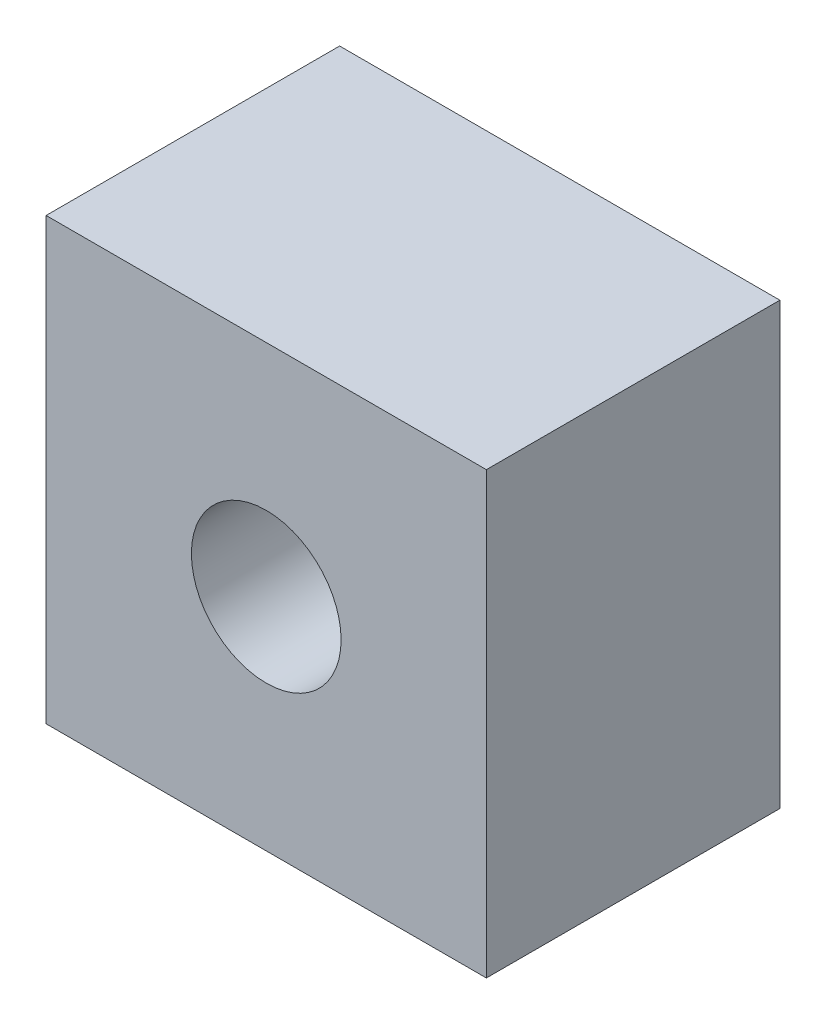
ISO-10303-21;
HEADER;
FILE_DESCRIPTION(('STEP AP214'),'2;1');
FILE_NAME('part.step','',(''),(''),'','','');
FILE_SCHEMA(('AUTOMOTIVE_DESIGN { 1 0 10303 214 1 1 1 1 }'));
ENDSEC;
DATA;
#1=APPLICATION_CONTEXT('core data for automotive mechanical design processes');
#2=APPLICATION_PROTOCOL_DEFINITION('international standard','automotive_design',2000,#1);
#3=PRODUCT_CONTEXT('',#1,'mechanical');
#4=PRODUCT('Part','Part','',(#3));
#5=PRODUCT_RELATED_PRODUCT_CATEGORY('part','',(#4));
#6=PRODUCT_DEFINITION_FORMATION('','',#4);
#7=PRODUCT_DEFINITION_CONTEXT('part definition',#1,'design');
#8=PRODUCT_DEFINITION('design','',#6,#7);
#9=PRODUCT_DEFINITION_SHAPE('','',#8);
#10=(LENGTH_UNIT() NAMED_UNIT(*) SI_UNIT(.MILLI.,.METRE.));
#11=(NAMED_UNIT(*) PLANE_ANGLE_UNIT() SI_UNIT($,.RADIAN.));
#12=(NAMED_UNIT(*) SI_UNIT($,.STERADIAN.) SOLID_ANGLE_UNIT());
#13=UNCERTAINTY_MEASURE_WITH_UNIT(LENGTH_MEASURE(1.E-05),#10,'distance_accuracy_value','');
#14=(GEOMETRIC_REPRESENTATION_CONTEXT(3) GLOBAL_UNCERTAINTY_ASSIGNED_CONTEXT((#13)) GLOBAL_UNIT_ASSIGNED_CONTEXT((#10,
#11,#12)) REPRESENTATION_CONTEXT('',''));
#15=CARTESIAN_POINT('',(0.,0.,0.));
#16=DIRECTION('',(0.,0.,1.));
#17=DIRECTION('',(1.,0.,0.));
#18=AXIS2_PLACEMENT_3D('',#15,#16,#17);
#19=CARTESIAN_POINT('',(-15.,15.,0.));
#20=DIRECTION('',(0.,0.,-1.));
#21=DIRECTION('',(-1.,0.,0.));
#22=AXIS2_PLACEMENT_3D('',#19,#20,#21);
#23=PLANE('',#22);
#24=DIRECTION('',(0.,-1.,0.));
#25=VECTOR('',#24,1.);
#26=CARTESIAN_POINT('',(-15.,-15.,0.));
#27=LINE('',#26,#25);
#28=CARTESIAN_POINT('',(-15.,15.,0.));
#29=VERTEX_POINT('',#28);
#30=CARTESIAN_POINT('',(-15.,-15.,0.));
#31=VERTEX_POINT('',#30);
#32=EDGE_CURVE('E96',#29,#31,#27,.T.);
#33=ORIENTED_EDGE('',*,*,#32,.F.);
#34=DIRECTION('',(-1.,0.,0.));
#35=VECTOR('',#34,1.);
#36=CARTESIAN_POINT('',(-15.,15.,0.));
#37=LINE('',#36,#35);
#38=CARTESIAN_POINT('',(15.,15.,0.));
#39=VERTEX_POINT('',#38);
#40=EDGE_CURVE('E72',#39,#29,#37,.T.);
#41=ORIENTED_EDGE('',*,*,#40,.F.);
#42=DIRECTION('',(0.,1.,0.));
#43=VECTOR('',#42,1.);
#44=CARTESIAN_POINT('',(15.,-15.,0.));
#45=LINE('',#44,#43);
#46=CARTESIAN_POINT('',(15.,-15.,0.));
#47=VERTEX_POINT('',#46);
#48=EDGE_CURVE('E66',#47,#39,#45,.T.);
#49=ORIENTED_EDGE('',*,*,#48,.F.);
#50=DIRECTION('',(1.,0.,0.));
#51=VECTOR('',#50,1.);
#52=CARTESIAN_POINT('',(-15.,-15.,0.));
#53=LINE('',#52,#51);
#54=EDGE_CURVE('E88',#31,#47,#53,.T.);
#55=ORIENTED_EDGE('',*,*,#54,.F.);
#56=EDGE_LOOP('',(#33,#41,#49,#55));
#57=FACE_BOUND('',#56,.T.);
#58=CARTESIAN_POINT('',(0.,0.,0.));
#59=DIRECTION('',(0.,0.,1.));
#60=DIRECTION('',(1.,0.,0.));
#61=AXIS2_PLACEMENT_3D('',#58,#59,#60);
#62=CIRCLE('',#61,5.09999999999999);
#63=CARTESIAN_POINT('',(5.09999999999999,0.,0.));
#64=VERTEX_POINT('',#63);
#65=EDGE_CURVE('E112',#64,#64,#62,.T.);
#66=ORIENTED_EDGE('',*,*,#65,.T.);
#67=EDGE_LOOP('',(#66));
#68=FACE_BOUND('',#67,.T.);
#69=ADVANCED_FACE('F32',(#57,#68),#23,.T.);
#70=CARTESIAN_POINT('',(-15.,-15.,20.));
#71=DIRECTION('',(1.,0.,0.));
#72=DIRECTION('',(0.,1.,0.));
#73=AXIS2_PLACEMENT_3D('',#70,#71,#72);
#74=PLANE('',#73);
#75=ORIENTED_EDGE('',*,*,#32,.T.);
#76=DIRECTION('',(0.,0.,-1.));
#77=VECTOR('',#76,1.);
#78=CARTESIAN_POINT('',(-15.,-15.,20.));
#79=LINE('',#78,#77);
#80=CARTESIAN_POINT('',(-15.,-15.,20.));
#81=VERTEX_POINT('',#80);
#82=EDGE_CURVE('E11',#81,#31,#79,.T.);
#83=ORIENTED_EDGE('',*,*,#82,.F.);
#84=DIRECTION('',(0.,-1.,0.));
#85=VECTOR('',#84,1.);
#86=CARTESIAN_POINT('',(-15.,-15.,20.));
#87=LINE('',#86,#85);
#88=CARTESIAN_POINT('',(-15.,15.,20.));
#89=VERTEX_POINT('',#88);
#90=EDGE_CURVE('E84',#89,#81,#87,.T.);
#91=ORIENTED_EDGE('',*,*,#90,.F.);
#92=DIRECTION('',(0.,0.,-1.));
#93=VECTOR('',#92,1.);
#94=CARTESIAN_POINT('',(-15.,15.,20.));
#95=LINE('',#94,#93);
#96=EDGE_CURVE('E92',#89,#29,#95,.T.);
#97=ORIENTED_EDGE('',*,*,#96,.T.);
#98=EDGE_LOOP('',(#75,#83,#91,#97));
#99=FACE_BOUND('',#98,.T.);
#100=ADVANCED_FACE('F34',(#99),#74,.F.);
#101=CARTESIAN_POINT('',(-15.,-15.,20.));
#102=DIRECTION('',(0.,1.,0.));
#103=DIRECTION('',(0.,0.,1.));
#104=AXIS2_PLACEMENT_3D('',#101,#102,#103);
#105=PLANE('',#104);
#106=ORIENTED_EDGE('',*,*,#54,.T.);
#107=DIRECTION('',(0.,0.,-1.));
#108=VECTOR('',#107,1.);
#109=CARTESIAN_POINT('',(15.,-15.,20.));
#110=LINE('',#109,#108);
#111=CARTESIAN_POINT('',(15.,-15.,20.));
#112=VERTEX_POINT('',#111);
#113=EDGE_CURVE('E41',#112,#47,#110,.T.);
#114=ORIENTED_EDGE('',*,*,#113,.F.);
#115=DIRECTION('',(1.,0.,0.));
#116=VECTOR('',#115,1.);
#117=CARTESIAN_POINT('',(-15.,-15.,20.));
#118=LINE('',#117,#116);
#119=EDGE_CURVE('E79',#81,#112,#118,.T.);
#120=ORIENTED_EDGE('',*,*,#119,.F.);
#121=ORIENTED_EDGE('',*,*,#82,.T.);
#122=EDGE_LOOP('',(#106,#114,#120,#121));
#123=FACE_BOUND('',#122,.T.);
#124=ADVANCED_FACE('F87',(#123),#105,.F.);
#125=CARTESIAN_POINT('',(15.,-15.,20.));
#126=DIRECTION('',(-1.,0.,0.));
#127=DIRECTION('',(0.,-1.,0.));
#128=AXIS2_PLACEMENT_3D('',#125,#126,#127);
#129=PLANE('',#128);
#130=ORIENTED_EDGE('',*,*,#48,.T.);
#131=DIRECTION('',(0.,0.,-1.));
#132=VECTOR('',#131,1.);
#133=CARTESIAN_POINT('',(15.,15.,20.));
#134=LINE('',#133,#132);
#135=CARTESIAN_POINT('',(15.,15.,20.));
#136=VERTEX_POINT('',#135);
#137=EDGE_CURVE('E89',#136,#39,#134,.T.);
#138=ORIENTED_EDGE('',*,*,#137,.F.);
#139=DIRECTION('',(0.,1.,0.));
#140=VECTOR('',#139,1.);
#141=CARTESIAN_POINT('',(15.,-15.,20.));
#142=LINE('',#141,#140);
#143=EDGE_CURVE('E82',#112,#136,#142,.T.);
#144=ORIENTED_EDGE('',*,*,#143,.F.);
#145=ORIENTED_EDGE('',*,*,#113,.T.);
#146=EDGE_LOOP('',(#130,#138,#144,#145));
#147=FACE_BOUND('',#146,.T.);
#148=ADVANCED_FACE('F90',(#147),#129,.F.);
#149=CARTESIAN_POINT('',(-15.,15.,20.));
#150=DIRECTION('',(0.,-1.,0.));
#151=DIRECTION('',(0.,0.,-1.));
#152=AXIS2_PLACEMENT_3D('',#149,#150,#151);
#153=PLANE('',#152);
#154=ORIENTED_EDGE('',*,*,#40,.T.);
#155=ORIENTED_EDGE('',*,*,#96,.F.);
#156=DIRECTION('',(-1.,0.,0.));
#157=VECTOR('',#156,1.);
#158=CARTESIAN_POINT('',(-15.,15.,20.));
#159=LINE('',#158,#157);
#160=EDGE_CURVE('E49',#136,#89,#159,.T.);
#161=ORIENTED_EDGE('',*,*,#160,.F.);
#162=ORIENTED_EDGE('',*,*,#137,.T.);
#163=EDGE_LOOP('',(#154,#155,#161,#162));
#164=FACE_BOUND('',#163,.T.);
#165=ADVANCED_FACE('F104',(#164),#153,.F.);
#166=CARTESIAN_POINT('',(-15.,15.,20.));
#167=DIRECTION('',(0.,0.,-1.));
#168=DIRECTION('',(-1.,0.,0.));
#169=AXIS2_PLACEMENT_3D('',#166,#167,#168);
#170=PLANE('',#169);
#171=CARTESIAN_POINT('',(0.,0.,20.));
#172=DIRECTION('',(0.,0.,1.));
#173=DIRECTION('',(1.,0.,0.));
#174=AXIS2_PLACEMENT_3D('',#171,#172,#173);
#175=CIRCLE('',#174,5.09999999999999);
#176=CARTESIAN_POINT('',(5.09999999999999,0.,20.));
#177=VERTEX_POINT('',#176);
#178=EDGE_CURVE('E99',#177,#177,#175,.T.);
#179=ORIENTED_EDGE('',*,*,#178,.F.);
#180=EDGE_LOOP('',(#179));
#181=FACE_BOUND('',#180,.T.);
#182=ORIENTED_EDGE('',*,*,#90,.T.);
#183=ORIENTED_EDGE('',*,*,#119,.T.);
#184=ORIENTED_EDGE('',*,*,#143,.T.);
#185=ORIENTED_EDGE('',*,*,#160,.T.);
#186=EDGE_LOOP('',(#182,#183,#184,#185));
#187=FACE_BOUND('',#186,.T.);
#188=ADVANCED_FACE('F80',(#181,#187),#170,.F.);
#189=CARTESIAN_POINT('',(0.,0.,20.));
#190=DIRECTION('',(0.,0.,1.));
#191=DIRECTION('',(1.,0.,0.));
#192=AXIS2_PLACEMENT_3D('',#189,#190,#191);
#193=CYLINDRICAL_SURFACE('',#192,5.09999999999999);
#194=ORIENTED_EDGE('',*,*,#65,.F.);
#195=EDGE_LOOP('',(#194));
#196=FACE_BOUND('',#195,.T.);
#197=ORIENTED_EDGE('',*,*,#178,.T.);
#198=EDGE_LOOP('',(#197));
#199=FACE_BOUND('',#198,.T.);
#200=ADVANCED_FACE('F116',(#196,#199),#193,.F.);
#201=CLOSED_SHELL('',(#69,#100,#124,#148,#165,#188,#200));
#202=MANIFOLD_SOLID_BREP('B2',#201);
#203=ADVANCED_BREP_SHAPE_REPRESENTATION('',(#18,#202),#14);
#204=SHAPE_DEFINITION_REPRESENTATION(#9,#203);
ENDSEC;
END-ISO-10303-21;
